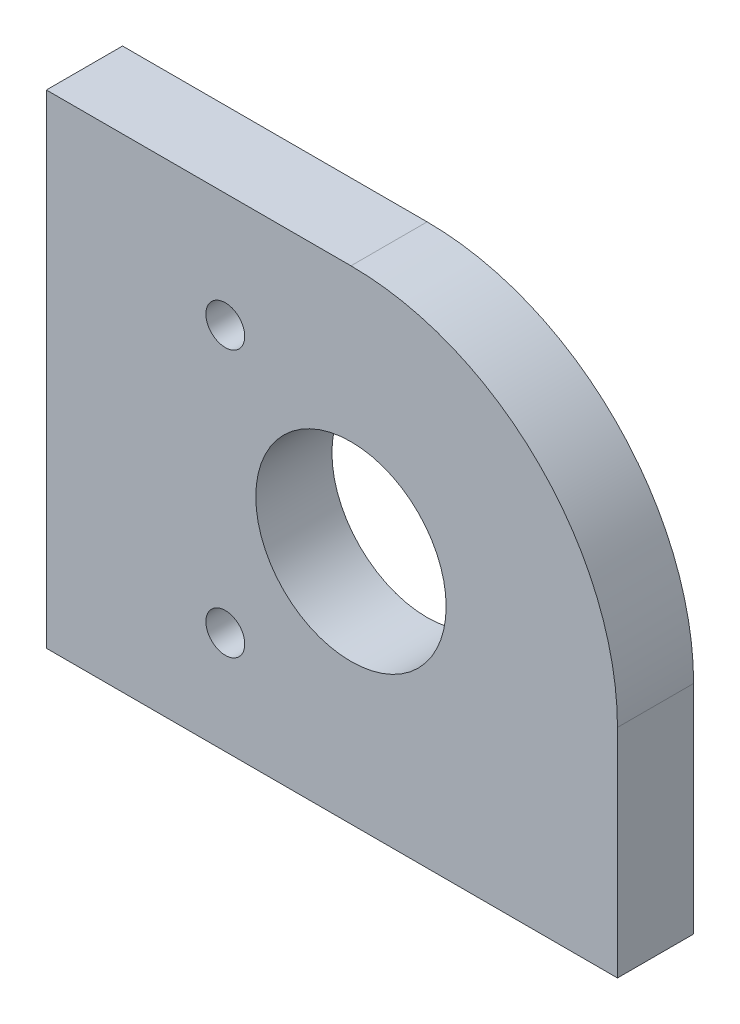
from build123d import *

# Parameters (mm, degrees)
ESQUISSE1_R        = 25
EXTRUSION1_DEPTH   = 20
TROU_TARAUD_M121_D = 10.2


with BuildPart() as part:
    # Esquisse1 → Extrusion1 (new body)
    with BuildSketch(Plane.XY):
        with BuildLine():
            Line((0, 65), (-80, 65))
            Line((-80, 65), (-80, -62))
            Line((-80, -62), (70, -62))
            Line((70, -62), (70, -5))
            ThreePointArc((70, -5), (49.497474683, 44.497474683), (0, 65))
        make_face()
        Circle(ESQUISSE1_R, mode=Mode.SUBTRACT)
    extrude(amount=EXTRUSION1_DEPTH)

    # Trou taraud_ M121 (through all)
    with Locations(Plane.XY.offset(20)):
        with Locations((-33, 35), (-33, -35)):
            Hole(TROU_TARAUD_M121_D / 2)


solid = part.part
